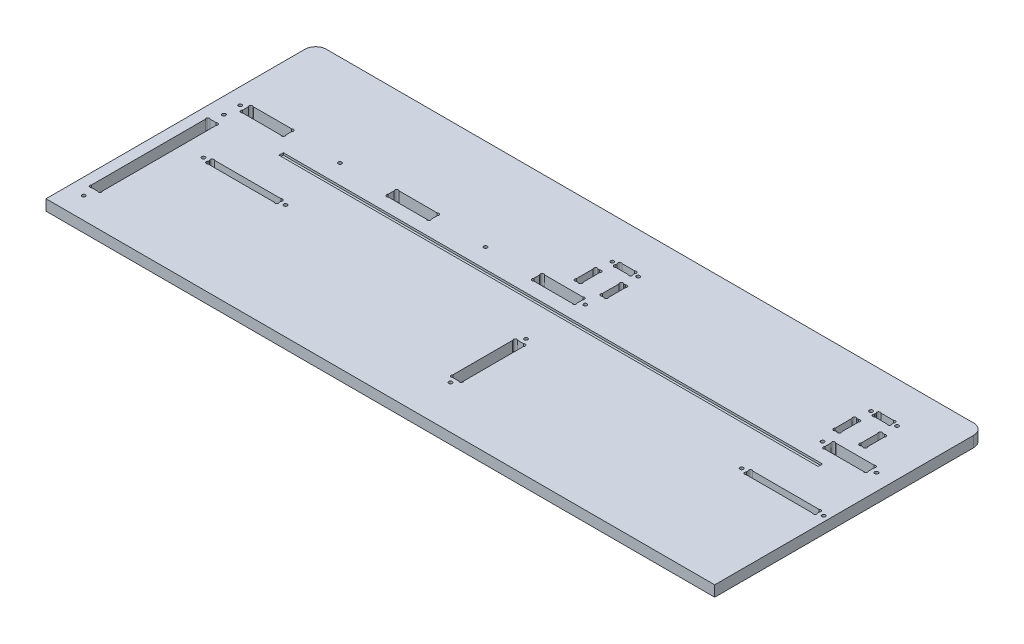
from build123d import *

# Parameters (mm, degrees)
ESQUISSE1_R             = 1.6
EXTRUSION1_DEPTH        = 10
ESQUISSE2_W             = 500
ESQUISSE2_H             = 4
ENL_V_MAT_EXTRU_1_DEPTH = 2


with BuildPart() as part:
    # Esquisse1 → Extrusion1 (new body)
    with BuildSketch(Plane(origin=(0, 0, 0), x_dir=(1, 0, 0), z_dir=(0, 1, 0))):
        with BuildLine():
            Line((10, 250), (610, 250))
            ThreePointArc((610, 250), (617.071067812, 247.071067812), (620, 240))
            Line((620, 240), (620, 0))
            Line((620, 0), (0, 0))
            Line((0, 0), (0, 240))
            ThreePointArc((0, 240), (2.928932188, 247.071067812), (10, 250))
        make_face()
        with Locations(Location((313, 212, 0), (0, 0, 270))):
            Circle(ESQUISSE1_R, mode=Mode.SUBTRACT)
        with Locations(Location((337, 212, 0), (0, 0, 90))):
            Circle(ESQUISSE1_R, mode=Mode.SUBTRACT)
        with Locations(Location((553, 212, 0), (0, 0, 270))):
            Circle(ESQUISSE1_R, mode=Mode.SUBTRACT)
        with Locations(Location((577, 212, 0), (0, 0, 90))):
            Circle(ESQUISSE1_R, mode=Mode.SUBTRACT)
        with Locations(Location((555, 165, 0), (0, 0, 270))):
            Circle(ESQUISSE1_R, mode=Mode.SUBTRACT)
        with Locations(Location((605, 165, 0), (0, 0, 90))):
            Circle(ESQUISSE1_R, mode=Mode.SUBTRACT)
        with Locations(Location((335, 165, 0), (0, 0, 90))):
            Circle(ESQUISSE1_R, mode=Mode.SUBTRACT)
        with Locations(Location((15, 165, 0), (0, 0, 270))):
            Circle(ESQUISSE1_R, mode=Mode.SUBTRACT)
        with Locations(Location((242.5, 165, 0), (0, 0, 270))):
            Circle(ESQUISSE1_R, mode=Mode.SUBTRACT)
        with Locations(Location((107.5, 165, 0), (0, 0, 90))):
            Circle(ESQUISSE1_R, mode=Mode.SUBTRACT)
        with Locations(Location((15, 20, 0), (0, 0, 270))):
            Circle(ESQUISSE1_R, mode=Mode.SUBTRACT)
        with Locations(Location((15, 150, 0), (0, 0, 90))):
            Circle(ESQUISSE1_R, mode=Mode.SUBTRACT)
        with Locations(Location((335, 40, 0), (0, 0, 270))):
            Circle(ESQUISSE1_R, mode=Mode.SUBTRACT)
        with Locations(Location((335, 110, 0), (0, 0, 90))):
            Circle(ESQUISSE1_R, mode=Mode.SUBTRACT)
        with Locations(Location((615, 106, 0), (0, 0, 270))):
            Circle(ESQUISSE1_R, mode=Mode.SUBTRACT)
        with Locations(Location((539, 106, 0), (0, 0, 90))):
            Circle(ESQUISSE1_R, mode=Mode.SUBTRACT)
        with Locations(Location((116, 106, 0), (0, 0, 270))):
            Circle(ESQUISSE1_R, mode=Mode.SUBTRACT)
        with Locations(Location((40, 106, 0), (0, 0, 90))):
            Circle(ESQUISSE1_R, mode=Mode.SUBTRACT)
        with BuildLine():
            Line((317, 211.2627417), (317, 212.7372583))
            ThreePointArc((317, 212.7372583), (317, 215), (319.2627417, 215))
            Line((319.2627417, 215), (330.7372583, 215))
            ThreePointArc((330.7372583, 215), (333, 215), (333, 212.7372583))
            Line((333, 212.7372583), (333, 211.2627417))
            ThreePointArc((333, 211.2627417), (333, 209), (330.7372583, 209))
            Line((330.7372583, 209), (319.2627417, 209))
            ThreePointArc((319.2627417, 209), (317, 209), (317, 211.2627417))
        make_face(mode=Mode.SUBTRACT)
        with BuildLine():
            Line((312.2627417, 179.5), (313.7372583, 179.5))
            ThreePointArc((313.7372583, 179.5), (316, 179.5), (316, 181.7627417))
            Line((316, 181.7627417), (316, 197.2372583))
            ThreePointArc((316, 197.2372583), (316, 199.5), (313.7372583, 199.5))
            Line((313.7372583, 199.5), (312.2627417, 199.5))
            ThreePointArc((312.2627417, 199.5), (310, 199.5), (310, 197.2372583))
            Line((310, 197.2372583), (310, 181.7627417))
            ThreePointArc((310, 181.7627417), (310, 179.5), (312.2627417, 179.5))
        make_face(mode=Mode.SUBTRACT)
        with BuildLine():
            Line((334, 181.7627417), (334, 197.2372583))
            ThreePointArc((334, 197.2372583), (334, 199.5), (336.2627417, 199.5))
            Line((336.2627417, 199.5), (337.7372583, 199.5))
            ThreePointArc((337.7372583, 199.5), (340, 199.5), (340, 197.2372583))
            Line((340, 197.2372583), (340, 181.7627417))
            ThreePointArc((340, 181.7627417), (340, 179.5), (337.7372583, 179.5))
            Line((337.7372583, 179.5), (336.2627417, 179.5))
            ThreePointArc((336.2627417, 179.5), (334, 179.5), (334, 181.7627417))
        make_face(mode=Mode.SUBTRACT)
        with BuildLine():
            Line((552.2627417, 179.5), (553.7372583, 179.5))
            ThreePointArc((553.7372583, 179.5), (556, 179.5), (556, 181.7627417))
            Line((556, 181.7627417), (556, 197.2372583))
            ThreePointArc((556, 197.2372583), (556, 199.5), (553.7372583, 199.5))
            Line((553.7372583, 199.5), (552.2627417, 199.5))
            ThreePointArc((552.2627417, 199.5), (550, 199.5), (550, 197.2372583))
            Line((550, 197.2372583), (550, 181.7627417))
            ThreePointArc((550, 181.7627417), (550, 179.5), (552.2627417, 179.5))
        make_face(mode=Mode.SUBTRACT)
        with BuildLine():
            Line((574, 181.7627417), (574, 197.2372583))
            ThreePointArc((574, 197.2372583), (574, 199.5), (576.2627417, 199.5))
            Line((576.2627417, 199.5), (577.7372583, 199.5))
            ThreePointArc((577.7372583, 199.5), (580, 199.5), (580, 197.2372583))
            Line((580, 197.2372583), (580, 181.7627417))
            ThreePointArc((580, 181.7627417), (580, 179.5), (577.7372583, 179.5))
            Line((577.7372583, 179.5), (576.2627417, 179.5))
            ThreePointArc((576.2627417, 179.5), (574, 179.5), (574, 181.7627417))
        make_face(mode=Mode.SUBTRACT)
        with BuildLine():
            Line((559.2627417, 209), (570.7372583, 209))
            ThreePointArc((570.7372583, 209), (573, 209), (573, 211.2627417))
            Line((573, 211.2627417), (573, 212.7372583))
            ThreePointArc((573, 212.7372583), (573, 215), (570.7372583, 215))
            Line((570.7372583, 215), (559.2627417, 215))
            ThreePointArc((559.2627417, 215), (557, 215), (557, 212.7372583))
            Line((557, 212.7372583), (557, 211.2627417))
            ThreePointArc((557, 211.2627417), (557, 209), (559.2627417, 209))
        make_face(mode=Mode.SUBTRACT)
        with BuildLine():
            Line((560, 167.7372583), (560, 162.2627417))
            ThreePointArc((560, 162.2627417), (560, 160), (562.2627417, 160))
            Line((562.2627417, 160), (597.7372583, 160))
            ThreePointArc((597.7372583, 160), (600, 160), (600, 162.2627417))
            Line((600, 162.2627417), (600, 167.7372583))
            ThreePointArc((600, 167.7372583), (600, 170), (597.7372583, 170))
            Line((597.7372583, 170), (562.2627417, 170))
            ThreePointArc((562.2627417, 170), (560, 170), (560, 167.7372583))
        make_face(mode=Mode.SUBTRACT)
        with BuildLine():
            Line((292.2627417, 160), (327.7372583, 160))
            ThreePointArc((327.7372583, 160), (330, 160), (330, 162.2627417))
            Line((330, 162.2627417), (330, 167.7372583))
            ThreePointArc((330, 167.7372583), (330, 170), (327.7372583, 170))
            Line((327.7372583, 170), (292.2627417, 170))
            ThreePointArc((292.2627417, 170), (290, 170), (290, 167.7372583))
            Line((290, 167.7372583), (290, 162.2627417))
            ThreePointArc((290, 162.2627417), (290, 160), (292.2627417, 160))
        make_face(mode=Mode.SUBTRACT)
        with BuildLine():
            Line((20, 167.7372583), (20, 162.2627417))
            ThreePointArc((20, 162.2627417), (20, 160), (22.2627417, 160))
            Line((22.2627417, 160), (57.7372583, 160))
            ThreePointArc((57.7372583, 160), (60, 160), (60, 162.2627417))
            Line((60, 162.2627417), (60, 167.7372583))
            ThreePointArc((60, 167.7372583), (60, 170), (57.7372583, 170))
            Line((57.7372583, 170), (22.2627417, 170))
            ThreePointArc((22.2627417, 170), (20, 170), (20, 167.7372583))
        make_face(mode=Mode.SUBTRACT)
        with BuildLine():
            Line((155, 167.7372583), (155, 162.2627417))
            ThreePointArc((155, 162.2627417), (155, 160), (157.2627417, 160))
            Line((157.2627417, 160), (192.7372583, 160))
            ThreePointArc((192.7372583, 160), (195, 160), (195, 162.2627417))
            Line((195, 162.2627417), (195, 167.7372583))
            ThreePointArc((195, 167.7372583), (195, 170), (192.7372583, 170))
            Line((192.7372583, 170), (157.2627417, 170))
            ThreePointArc((157.2627417, 170), (155, 170), (155, 167.7372583))
        make_face(mode=Mode.SUBTRACT)
        with BuildLine():
            Line((12.2627417, 30), (17.7372583, 30))
            ThreePointArc((17.7372583, 30), (20, 30), (20, 32.2627417))
            Line((20, 32.2627417), (20, 137.7372583))
            ThreePointArc((20, 137.7372583), (20, 140), (17.7372583, 140))
            Line((17.7372583, 140), (12.2627417, 140))
            ThreePointArc((12.2627417, 140), (10, 140), (10, 137.7372583))
            Line((10, 137.7372583), (10, 32.2627417))
            ThreePointArc((10, 32.2627417), (10, 30), (12.2627417, 30))
        make_face(mode=Mode.SUBTRACT)
        with BuildLine():
            Line((337.7372583, 45), (332.2627417, 45))
            ThreePointArc((332.2627417, 45), (330, 45), (330, 47.2627417))
            Line((330, 47.2627417), (330, 102.7372583))
            ThreePointArc((330, 102.7372583), (330, 105), (332.2627417, 105))
            Line((332.2627417, 105), (337.7372583, 105))
            ThreePointArc((337.7372583, 105), (340, 105), (340, 102.7372583))
            Line((340, 102.7372583), (340, 47.2627417))
            ThreePointArc((340, 47.2627417), (340, 45), (337.7372583, 45))
        make_face(mode=Mode.SUBTRACT)
        with BuildLine():
            Line((610, 105.2627417), (610, 106.7372583))
            ThreePointArc((610, 106.7372583), (610, 109), (607.7372583, 109))
            Line((607.7372583, 109), (546.2627417, 109))
            ThreePointArc((546.2627417, 109), (544, 109), (544, 106.7372583))
            Line((544, 106.7372583), (544, 105.2627417))
            ThreePointArc((544, 105.2627417), (544, 103), (546.2627417, 103))
            Line((546.2627417, 103), (607.7372583, 103))
            ThreePointArc((607.7372583, 103), (610, 103), (610, 105.2627417))
        make_face(mode=Mode.SUBTRACT)
        with BuildLine():
            Line((108.7372583, 109), (47.2627417, 109))
            ThreePointArc((47.2627417, 109), (45, 109), (45, 106.7372583))
            Line((45, 106.7372583), (45, 105.2627417))
            ThreePointArc((45, 105.2627417), (45, 103), (47.2627417, 103))
            Line((47.2627417, 103), (108.7372583, 103))
            ThreePointArc((108.7372583, 103), (111, 103), (111, 105.2627417))
            Line((111, 105.2627417), (111, 106.7372583))
            ThreePointArc((111, 106.7372583), (111, 109), (108.7372583, 109))
        make_face(mode=Mode.SUBTRACT)
    extrude(amount=EXTRUSION1_DEPTH)

    # Esquisse2 → Enl_v. mat.-Extru.1 (cut)
    with BuildSketch(Plane(origin=(0, 10, 0), x_dir=(-1, 0, 0), z_dir=(0, 1, 0))):
        with Locations((-323, -145)):
            Rectangle(ESQUISSE2_W, ESQUISSE2_H)
    extrude(amount=-ENL_V_MAT_EXTRU_1_DEPTH, mode=Mode.SUBTRACT)


solid = part.part
